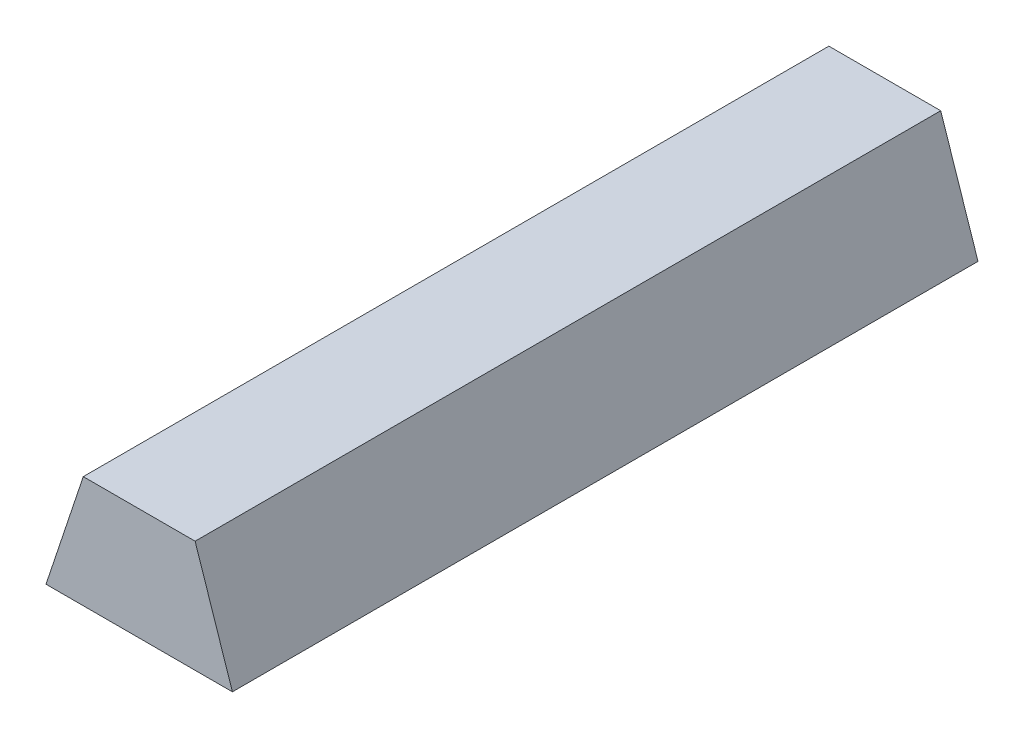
ISO-10303-21;
HEADER;
FILE_DESCRIPTION(('STEP AP214'),'2;1');
FILE_NAME('part.step','',(''),(''),'','','');
FILE_SCHEMA(('AUTOMOTIVE_DESIGN { 1 0 10303 214 1 1 1 1 }'));
ENDSEC;
DATA;
#1=APPLICATION_CONTEXT('core data for automotive mechanical design processes');
#2=APPLICATION_PROTOCOL_DEFINITION('international standard','automotive_design',2000,#1);
#3=PRODUCT_CONTEXT('',#1,'mechanical');
#4=PRODUCT('Part','Part','',(#3));
#5=PRODUCT_RELATED_PRODUCT_CATEGORY('part','',(#4));
#6=PRODUCT_DEFINITION_FORMATION('','',#4);
#7=PRODUCT_DEFINITION_CONTEXT('part definition',#1,'design');
#8=PRODUCT_DEFINITION('design','',#6,#7);
#9=PRODUCT_DEFINITION_SHAPE('','',#8);
#10=(LENGTH_UNIT() NAMED_UNIT(*) SI_UNIT(.MILLI.,.METRE.));
#11=(NAMED_UNIT(*) PLANE_ANGLE_UNIT() SI_UNIT($,.RADIAN.));
#12=(NAMED_UNIT(*) SI_UNIT($,.STERADIAN.) SOLID_ANGLE_UNIT());
#13=UNCERTAINTY_MEASURE_WITH_UNIT(LENGTH_MEASURE(1.E-05),#10,'distance_accuracy_value','');
#14=(GEOMETRIC_REPRESENTATION_CONTEXT(3) GLOBAL_UNCERTAINTY_ASSIGNED_CONTEXT((#13)) GLOBAL_UNIT_ASSIGNED_CONTEXT((#10,
#11,#12)) REPRESENTATION_CONTEXT('',''));
#15=CARTESIAN_POINT('',(0.,0.,0.));
#16=DIRECTION('',(0.,0.,1.));
#17=DIRECTION('',(1.,0.,0.));
#18=AXIS2_PLACEMENT_3D('',#15,#16,#17);
#19=CARTESIAN_POINT('',(180.,60.,2000.));
#20=DIRECTION('',(0.948683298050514,0.316227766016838,0.));
#21=DIRECTION('',(-0.316227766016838,0.948683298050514,0.));
#22=AXIS2_PLACEMENT_3D('',#19,#20,#21);
#23=PLANE('',#22);
#24=DIRECTION('',(0.316227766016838,-0.948683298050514,0.));
#25=VECTOR('',#24,1.);
#26=CARTESIAN_POINT('',(180.,60.,0.));
#27=LINE('',#26,#25);
#28=CARTESIAN_POINT('',(150.,150.,0.));
#29=VERTEX_POINT('',#28);
#30=CARTESIAN_POINT('',(250.,-150.,0.));
#31=VERTEX_POINT('',#30);
#32=EDGE_CURVE('E110',#29,#31,#27,.T.);
#33=ORIENTED_EDGE('',*,*,#32,.F.);
#34=DIRECTION('',(0.,0.,-1.));
#35=VECTOR('',#34,1.);
#36=CARTESIAN_POINT('',(150.,150.,2000.));
#37=LINE('',#36,#35);
#38=CARTESIAN_POINT('',(150.,150.,2000.));
#39=VERTEX_POINT('',#38);
#40=EDGE_CURVE('E11',#39,#29,#37,.T.);
#41=ORIENTED_EDGE('',*,*,#40,.F.);
#42=DIRECTION('',(0.316227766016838,-0.948683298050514,0.));
#43=VECTOR('',#42,1.);
#44=CARTESIAN_POINT('',(180.,60.,2000.));
#45=LINE('',#44,#43);
#46=CARTESIAN_POINT('',(250.,-150.,2000.));
#47=VERTEX_POINT('',#46);
#48=EDGE_CURVE('E101',#39,#47,#45,.T.);
#49=ORIENTED_EDGE('',*,*,#48,.T.);
#50=DIRECTION('',(0.,0.,-1.));
#51=VECTOR('',#50,1.);
#52=CARTESIAN_POINT('',(250.,-150.,2000.));
#53=LINE('',#52,#51);
#54=EDGE_CURVE('E80',#47,#31,#53,.T.);
#55=ORIENTED_EDGE('',*,*,#54,.T.);
#56=EDGE_LOOP('',(#33,#41,#49,#55));
#57=FACE_BOUND('',#56,.T.);
#58=ADVANCED_FACE('F41',(#57),#23,.T.);
#59=CARTESIAN_POINT('',(0.,150.,2000.));
#60=DIRECTION('',(0.,1.,0.));
#61=DIRECTION('',(0.,0.,1.));
#62=AXIS2_PLACEMENT_3D('',#59,#60,#61);
#63=PLANE('',#62);
#64=DIRECTION('',(1.,0.,0.));
#65=VECTOR('',#64,1.);
#66=CARTESIAN_POINT('',(0.,150.,0.));
#67=LINE('',#66,#65);
#68=CARTESIAN_POINT('',(-150.,150.,0.));
#69=VERTEX_POINT('',#68);
#70=EDGE_CURVE('E93',#69,#29,#67,.T.);
#71=ORIENTED_EDGE('',*,*,#70,.F.);
#72=DIRECTION('',(0.,0.,-1.));
#73=VECTOR('',#72,1.);
#74=CARTESIAN_POINT('',(-150.,150.,2000.));
#75=LINE('',#74,#73);
#76=CARTESIAN_POINT('',(-150.,150.,2000.));
#77=VERTEX_POINT('',#76);
#78=EDGE_CURVE('E50',#77,#69,#75,.T.);
#79=ORIENTED_EDGE('',*,*,#78,.F.);
#80=DIRECTION('',(1.,0.,0.));
#81=VECTOR('',#80,1.);
#82=CARTESIAN_POINT('',(0.,150.,2000.));
#83=LINE('',#82,#81);
#84=EDGE_CURVE('E91',#77,#39,#83,.T.);
#85=ORIENTED_EDGE('',*,*,#84,.T.);
#86=ORIENTED_EDGE('',*,*,#40,.T.);
#87=EDGE_LOOP('',(#71,#79,#85,#86));
#88=FACE_BOUND('',#87,.T.);
#89=ADVANCED_FACE('F89',(#88),#63,.T.);
#90=CARTESIAN_POINT('',(-180.,60.,2000.));
#91=DIRECTION('',(0.948683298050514,-0.316227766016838,0.));
#92=DIRECTION('',(0.316227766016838,0.948683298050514,0.));
#93=AXIS2_PLACEMENT_3D('',#90,#91,#92);
#94=PLANE('',#93);
#95=DIRECTION('',(-0.316227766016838,-0.948683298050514,0.));
#96=VECTOR('',#95,1.);
#97=CARTESIAN_POINT('',(-180.,60.,0.));
#98=LINE('',#97,#96);
#99=CARTESIAN_POINT('',(-250.,-150.,0.));
#100=VERTEX_POINT('',#99);
#101=EDGE_CURVE('E73',#69,#100,#98,.T.);
#102=ORIENTED_EDGE('',*,*,#101,.T.);
#103=DIRECTION('',(0.,0.,-1.));
#104=VECTOR('',#103,1.);
#105=CARTESIAN_POINT('',(-250.,-150.,2000.));
#106=LINE('',#105,#104);
#107=CARTESIAN_POINT('',(-250.,-150.,2000.));
#108=VERTEX_POINT('',#107);
#109=EDGE_CURVE('E95',#108,#100,#106,.T.);
#110=ORIENTED_EDGE('',*,*,#109,.F.);
#111=DIRECTION('',(-0.316227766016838,-0.948683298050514,0.));
#112=VECTOR('',#111,1.);
#113=CARTESIAN_POINT('',(-180.,60.,2000.));
#114=LINE('',#113,#112);
#115=EDGE_CURVE('E96',#77,#108,#114,.T.);
#116=ORIENTED_EDGE('',*,*,#115,.F.);
#117=ORIENTED_EDGE('',*,*,#78,.T.);
#118=EDGE_LOOP('',(#102,#110,#116,#117));
#119=FACE_BOUND('',#118,.T.);
#120=ADVANCED_FACE('F97',(#119),#94,.F.);
#121=CARTESIAN_POINT('',(0.,-150.,2000.));
#122=DIRECTION('',(0.,1.,0.));
#123=DIRECTION('',(0.,0.,1.));
#124=AXIS2_PLACEMENT_3D('',#121,#122,#123);
#125=PLANE('',#124);
#126=DIRECTION('',(1.,0.,0.));
#127=VECTOR('',#126,1.);
#128=CARTESIAN_POINT('',(0.,-150.,0.));
#129=LINE('',#128,#127);
#130=EDGE_CURVE('E105',#100,#31,#129,.T.);
#131=ORIENTED_EDGE('',*,*,#130,.T.);
#132=ORIENTED_EDGE('',*,*,#54,.F.);
#133=DIRECTION('',(1.,0.,0.));
#134=VECTOR('',#133,1.);
#135=CARTESIAN_POINT('',(0.,-150.,2000.));
#136=LINE('',#135,#134);
#137=EDGE_CURVE('E58',#108,#47,#136,.T.);
#138=ORIENTED_EDGE('',*,*,#137,.F.);
#139=ORIENTED_EDGE('',*,*,#109,.T.);
#140=EDGE_LOOP('',(#131,#132,#138,#139));
#141=FACE_BOUND('',#140,.T.);
#142=ADVANCED_FACE('F125',(#141),#125,.F.);
#143=CARTESIAN_POINT('',(0.,0.,2000.));
#144=DIRECTION('',(0.,0.,1.));
#145=DIRECTION('',(1.,0.,0.));
#146=AXIS2_PLACEMENT_3D('',#143,#144,#145);
#147=PLANE('',#146);
#148=ORIENTED_EDGE('',*,*,#48,.F.);
#149=ORIENTED_EDGE('',*,*,#84,.F.);
#150=ORIENTED_EDGE('',*,*,#115,.T.);
#151=ORIENTED_EDGE('',*,*,#137,.T.);
#152=EDGE_LOOP('',(#148,#149,#150,#151));
#153=FACE_BOUND('',#152,.T.);
#154=ADVANCED_FACE('F100',(#153),#147,.T.);
#155=CARTESIAN_POINT('',(0.,0.,0.));
#156=DIRECTION('',(0.,0.,1.));
#157=DIRECTION('',(1.,0.,0.));
#158=AXIS2_PLACEMENT_3D('',#155,#156,#157);
#159=PLANE('',#158);
#160=ORIENTED_EDGE('',*,*,#32,.T.);
#161=ORIENTED_EDGE('',*,*,#130,.F.);
#162=ORIENTED_EDGE('',*,*,#101,.F.);
#163=ORIENTED_EDGE('',*,*,#70,.T.);
#164=EDGE_LOOP('',(#160,#161,#162,#163));
#165=FACE_BOUND('',#164,.T.);
#166=ADVANCED_FACE('F127',(#165),#159,.F.);
#167=CLOSED_SHELL('',(#58,#89,#120,#142,#154,#166));
#168=MANIFOLD_SOLID_BREP('B2',#167);
#169=ADVANCED_BREP_SHAPE_REPRESENTATION('',(#18,#168),#14);
#170=SHAPE_DEFINITION_REPRESENTATION(#9,#169);
ENDSEC;
END-ISO-10303-21;
